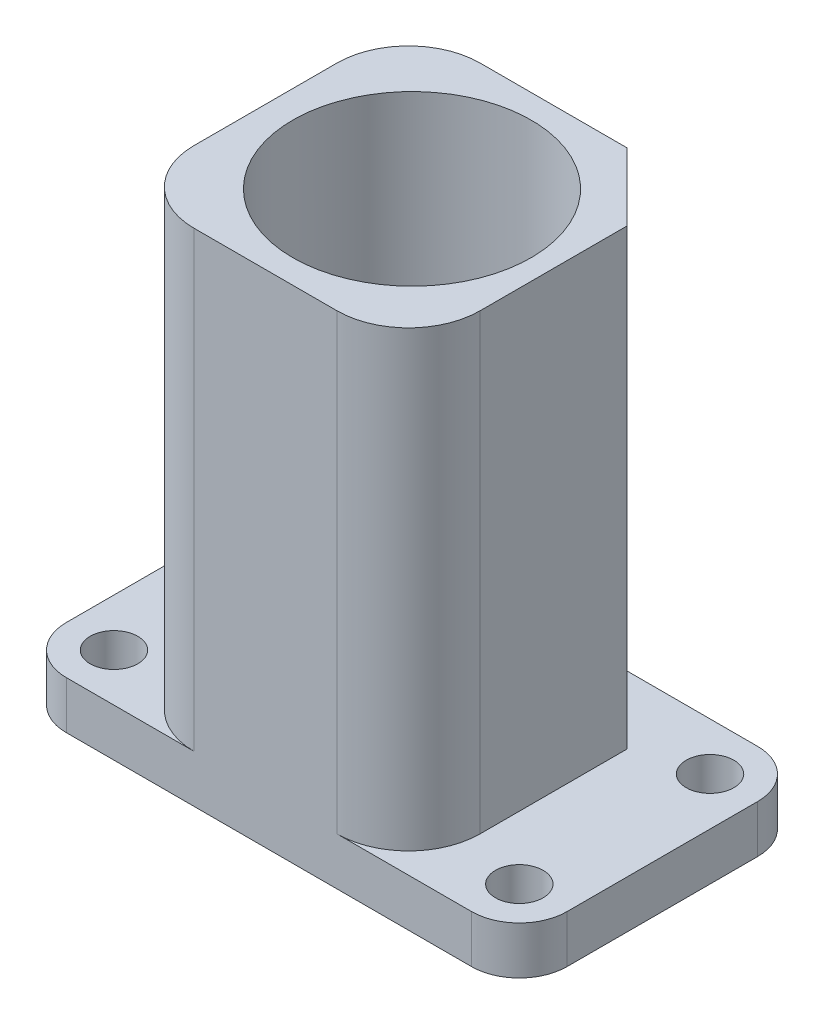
ISO-10303-21;
HEADER;
FILE_DESCRIPTION(('STEP AP214'),'2;1');
FILE_NAME('part.step','',(''),(''),'','','');
FILE_SCHEMA(('AUTOMOTIVE_DESIGN { 1 0 10303 214 1 1 1 1 }'));
ENDSEC;
DATA;
#1=APPLICATION_CONTEXT('core data for automotive mechanical design processes');
#2=APPLICATION_PROTOCOL_DEFINITION('international standard','automotive_design',2000,#1);
#3=PRODUCT_CONTEXT('',#1,'mechanical');
#4=PRODUCT('Part','Part','',(#3));
#5=PRODUCT_RELATED_PRODUCT_CATEGORY('part','',(#4));
#6=PRODUCT_DEFINITION_FORMATION('','',#4);
#7=PRODUCT_DEFINITION_CONTEXT('part definition',#1,'design');
#8=PRODUCT_DEFINITION('design','',#6,#7);
#9=PRODUCT_DEFINITION_SHAPE('','',#8);
#10=(LENGTH_UNIT() NAMED_UNIT(*) SI_UNIT(.MILLI.,.METRE.));
#11=(NAMED_UNIT(*) PLANE_ANGLE_UNIT() SI_UNIT($,.RADIAN.));
#12=(NAMED_UNIT(*) SI_UNIT($,.STERADIAN.) SOLID_ANGLE_UNIT());
#13=UNCERTAINTY_MEASURE_WITH_UNIT(LENGTH_MEASURE(1.E-05),#10,'distance_accuracy_value','');
#14=(GEOMETRIC_REPRESENTATION_CONTEXT(3) GLOBAL_UNCERTAINTY_ASSIGNED_CONTEXT((#13)) GLOBAL_UNIT_ASSIGNED_CONTEXT((#10,
#11,#12)) REPRESENTATION_CONTEXT('',''));
#15=CARTESIAN_POINT('',(0.,0.,0.));
#16=DIRECTION('',(0.,0.,1.));
#17=DIRECTION('',(1.,0.,0.));
#18=AXIS2_PLACEMENT_3D('',#15,#16,#17);
#19=CARTESIAN_POINT('',(0.,1.,0.));
#20=DIRECTION('',(0.,-1.,0.));
#21=DIRECTION('',(0.,0.,-1.));
#22=AXIS2_PLACEMENT_3D('',#19,#20,#21);
#23=PLANE('',#22);
#24=CARTESIAN_POINT('',(4.25,1.,2.));
#25=DIRECTION('',(0.,1.,0.));
#26=DIRECTION('',(0.,0.,1.));
#27=AXIS2_PLACEMENT_3D('',#24,#25,#26);
#28=CIRCLE('',#27,0.500000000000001);
#29=CARTESIAN_POINT('',(4.25,1.,2.5));
#30=VERTEX_POINT('',#29);
#31=EDGE_CURVE('E237',#30,#30,#28,.T.);
#32=ORIENTED_EDGE('',*,*,#31,.F.);
#33=EDGE_LOOP('',(#32));
#34=FACE_BOUND('',#33,.T.);
#35=CARTESIAN_POINT('',(4.25,1.,-2.));
#36=DIRECTION('',(0.,1.,0.));
#37=DIRECTION('',(0.,0.,1.));
#38=AXIS2_PLACEMENT_3D('',#35,#36,#37);
#39=CIRCLE('',#38,0.500000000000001);
#40=CARTESIAN_POINT('',(4.25,1.,-1.5));
#41=VERTEX_POINT('',#40);
#42=EDGE_CURVE('E248',#41,#41,#39,.T.);
#43=ORIENTED_EDGE('',*,*,#42,.F.);
#44=EDGE_LOOP('',(#43));
#45=FACE_BOUND('',#44,.T.);
#46=DIRECTION('',(1.,0.,0.));
#47=VECTOR('',#46,1.);
#48=CARTESIAN_POINT('',(4.25,1.,3.));
#49=LINE('',#48,#47);
#50=CARTESIAN_POINT('',(1.42744530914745,1.,3.));
#51=VERTEX_POINT('',#50);
#52=CARTESIAN_POINT('',(4.25,1.,3.));
#53=VERTEX_POINT('',#52);
#54=EDGE_CURVE('E54',#51,#53,#49,.T.);
#55=ORIENTED_EDGE('',*,*,#54,.T.);
#56=CARTESIAN_POINT('',(4.25,1.,2.));
#57=DIRECTION('',(0.,-1.,0.));
#58=DIRECTION('',(0.,0.,-1.));
#59=AXIS2_PLACEMENT_3D('',#56,#57,#58);
#60=CIRCLE('',#59,1.);
#61=CARTESIAN_POINT('',(5.25,1.,2.));
#62=VERTEX_POINT('',#61);
#63=EDGE_CURVE('E311',#53,#62,#60,.F.);
#64=ORIENTED_EDGE('',*,*,#63,.T.);
#65=DIRECTION('',(0.,0.,1.));
#66=VECTOR('',#65,1.);
#67=CARTESIAN_POINT('',(5.25,1.,-3.));
#68=LINE('',#67,#66);
#69=CARTESIAN_POINT('',(5.25,1.,-2.));
#70=VERTEX_POINT('',#69);
#71=EDGE_CURVE('E266',#70,#62,#68,.T.);
#72=ORIENTED_EDGE('',*,*,#71,.F.);
#73=CARTESIAN_POINT('',(4.25,1.,-2.));
#74=DIRECTION('',(0.,-1.,0.));
#75=DIRECTION('',(0.,0.,-1.));
#76=AXIS2_PLACEMENT_3D('',#73,#74,#75);
#77=CIRCLE('',#76,1.);
#78=CARTESIAN_POINT('',(4.25,1.,-3.));
#79=VERTEX_POINT('',#78);
#80=EDGE_CURVE('E397',#70,#79,#77,.F.);
#81=ORIENTED_EDGE('',*,*,#80,.T.);
#82=DIRECTION('',(-1.,0.,0.));
#83=VECTOR('',#82,1.);
#84=CARTESIAN_POINT('',(4.25,1.,-3.));
#85=LINE('',#84,#83);
#86=CARTESIAN_POINT('',(1.51323174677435,1.,-3.));
#87=VERTEX_POINT('',#86);
#88=EDGE_CURVE('E339',#79,#87,#85,.T.);
#89=ORIENTED_EDGE('',*,*,#88,.T.);
#90=DIRECTION('',(-0.707106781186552,0.,-0.707106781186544));
#91=VECTOR('',#90,1.);
#92=CARTESIAN_POINT('',(1.51323174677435,1.,-3.));
#93=LINE('',#92,#91);
#94=CARTESIAN_POINT('',(2.92744530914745,1.,-1.58578643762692));
#95=VERTEX_POINT('',#94);
#96=EDGE_CURVE('E291',#95,#87,#93,.T.);
#97=ORIENTED_EDGE('',*,*,#96,.F.);
#98=DIRECTION('',(0.,0.,-1.));
#99=VECTOR('',#98,1.);
#100=CARTESIAN_POINT('',(2.92744530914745,1.,-1.58578643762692));
#101=LINE('',#100,#99);
#102=CARTESIAN_POINT('',(2.92744530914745,1.,1.5));
#103=VERTEX_POINT('',#102);
#104=EDGE_CURVE('E310',#103,#95,#101,.T.);
#105=ORIENTED_EDGE('',*,*,#104,.F.);
#106=CARTESIAN_POINT('',(1.42744530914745,1.,1.5));
#107=DIRECTION('',(0.,-1.,0.));
#108=DIRECTION('',(0.,0.,-1.));
#109=AXIS2_PLACEMENT_3D('',#106,#107,#108);
#110=CIRCLE('',#109,1.5);
#111=EDGE_CURVE('E47',#103,#51,#110,.T.);
#112=ORIENTED_EDGE('',*,*,#111,.T.);
#113=EDGE_LOOP('',(#55,#64,#72,#81,#89,#97,#105,#112));
#114=FACE_BOUND('',#113,.T.);
#115=ADVANCED_FACE('F39',(#34,#45,#114),#23,.F.);
#116=CARTESIAN_POINT('',(-4.25,1.,2.));
#117=DIRECTION('',(0.,1.,0.));
#118=DIRECTION('',(0.,0.,1.));
#119=AXIS2_PLACEMENT_3D('',#116,#117,#118);
#120=CIRCLE('',#119,0.5);
#121=CARTESIAN_POINT('',(-4.25,1.,2.5));
#122=VERTEX_POINT('',#121);
#123=EDGE_CURVE('E254',#122,#122,#120,.T.);
#124=ORIENTED_EDGE('',*,*,#123,.F.);
#125=EDGE_LOOP('',(#124));
#126=FACE_BOUND('',#125,.T.);
#127=CARTESIAN_POINT('',(-4.25,1.,-2.));
#128=DIRECTION('',(0.,1.,0.));
#129=DIRECTION('',(0.,0.,1.));
#130=AXIS2_PLACEMENT_3D('',#127,#128,#129);
#131=CIRCLE('',#130,0.5);
#132=CARTESIAN_POINT('',(-4.25,1.,-1.5));
#133=VERTEX_POINT('',#132);
#134=EDGE_CURVE('E260',#133,#133,#131,.T.);
#135=ORIENTED_EDGE('',*,*,#134,.F.);
#136=EDGE_LOOP('',(#135));
#137=FACE_BOUND('',#136,.T.);
#138=DIRECTION('',(0.,0.,-1.));
#139=VECTOR('',#138,1.);
#140=CARTESIAN_POINT('',(-5.25,1.,-3.));
#141=LINE('',#140,#139);
#142=CARTESIAN_POINT('',(-5.25,1.,2.));
#143=VERTEX_POINT('',#142);
#144=CARTESIAN_POINT('',(-5.25,1.,-2.));
#145=VERTEX_POINT('',#144);
#146=EDGE_CURVE('E277',#143,#145,#141,.T.);
#147=ORIENTED_EDGE('',*,*,#146,.F.);
#148=CARTESIAN_POINT('',(-4.25,1.,2.));
#149=DIRECTION('',(0.,-1.,0.));
#150=DIRECTION('',(0.,0.,-1.));
#151=AXIS2_PLACEMENT_3D('',#148,#149,#150);
#152=CIRCLE('',#151,1.);
#153=CARTESIAN_POINT('',(-4.25,1.,3.));
#154=VERTEX_POINT('',#153);
#155=EDGE_CURVE('E783',#143,#154,#152,.F.);
#156=ORIENTED_EDGE('',*,*,#155,.T.);
#157=CARTESIAN_POINT('',(-1.57255469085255,1.,3.));
#158=VERTEX_POINT('',#157);
#159=EDGE_CURVE('E61',#154,#158,#49,.T.);
#160=ORIENTED_EDGE('',*,*,#159,.T.);
#161=CARTESIAN_POINT('',(-1.57255469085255,1.,1.5));
#162=DIRECTION('',(0.,-1.,0.));
#163=DIRECTION('',(0.,0.,-1.));
#164=AXIS2_PLACEMENT_3D('',#161,#162,#163);
#165=CIRCLE('',#164,1.5);
#166=CARTESIAN_POINT('',(-3.07255469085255,1.,1.5));
#167=VERTEX_POINT('',#166);
#168=EDGE_CURVE('E12',#158,#167,#165,.T.);
#169=ORIENTED_EDGE('',*,*,#168,.T.);
#170=DIRECTION('',(0.,0.,1.));
#171=VECTOR('',#170,1.);
#172=CARTESIAN_POINT('',(-3.07255469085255,1.,-3.));
#173=LINE('',#172,#171);
#174=CARTESIAN_POINT('',(-3.07255469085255,1.,-1.5));
#175=VERTEX_POINT('',#174);
#176=EDGE_CURVE('E286',#175,#167,#173,.T.);
#177=ORIENTED_EDGE('',*,*,#176,.F.);
#178=CARTESIAN_POINT('',(-1.57255469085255,1.,-1.5));
#179=DIRECTION('',(0.,-1.,0.));
#180=DIRECTION('',(0.,0.,-1.));
#181=AXIS2_PLACEMENT_3D('',#178,#179,#180);
#182=CIRCLE('',#181,1.5);
#183=CARTESIAN_POINT('',(-1.57255469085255,1.,-3.));
#184=VERTEX_POINT('',#183);
#185=EDGE_CURVE('E429',#175,#184,#182,.T.);
#186=ORIENTED_EDGE('',*,*,#185,.T.);
#187=CARTESIAN_POINT('',(-4.25,1.,-3.));
#188=VERTEX_POINT('',#187);
#189=EDGE_CURVE('E345',#184,#188,#85,.T.);
#190=ORIENTED_EDGE('',*,*,#189,.T.);
#191=CARTESIAN_POINT('',(-4.25,1.,-2.));
#192=DIRECTION('',(0.,-1.,0.));
#193=DIRECTION('',(0.,0.,-1.));
#194=AXIS2_PLACEMENT_3D('',#191,#192,#193);
#195=CIRCLE('',#194,1.);
#196=EDGE_CURVE('E342',#188,#145,#195,.F.);
#197=ORIENTED_EDGE('',*,*,#196,.T.);
#198=EDGE_LOOP('',(#147,#156,#160,#169,#177,#186,#190,#197));
#199=FACE_BOUND('',#198,.T.);
#200=ADVANCED_FACE('F435',(#126,#137,#199),#23,.F.);
#201=CARTESIAN_POINT('',(4.25,1.,3.));
#202=DIRECTION('',(0.,0.,-1.));
#203=DIRECTION('',(-1.,0.,0.));
#204=AXIS2_PLACEMENT_3D('',#201,#202,#203);
#205=PLANE('',#204);
#206=ORIENTED_EDGE('',*,*,#54,.F.);
#207=DIRECTION('',(0.,-1.,0.));
#208=VECTOR('',#207,1.);
#209=CARTESIAN_POINT('',(1.42744530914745,1.,3.));
#210=LINE('',#209,#208);
#211=CARTESIAN_POINT('',(1.42744530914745,10.5,3.));
#212=VERTEX_POINT('',#211);
#213=EDGE_CURVE('E444',#51,#212,#210,.F.);
#214=ORIENTED_EDGE('',*,*,#213,.T.);
#215=DIRECTION('',(1.,0.,0.));
#216=VECTOR('',#215,1.);
#217=CARTESIAN_POINT('',(2.92744530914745,10.5,3.));
#218=LINE('',#217,#216);
#219=CARTESIAN_POINT('',(-1.57255469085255,10.5,3.));
#220=VERTEX_POINT('',#219);
#221=EDGE_CURVE('E294',#220,#212,#218,.T.);
#222=ORIENTED_EDGE('',*,*,#221,.F.);
#223=DIRECTION('',(0.,-1.,0.));
#224=VECTOR('',#223,1.);
#225=CARTESIAN_POINT('',(-1.57255469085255,1.,3.));
#226=LINE('',#225,#224);
#227=EDGE_CURVE('E440',#220,#158,#226,.T.);
#228=ORIENTED_EDGE('',*,*,#227,.T.);
#229=ORIENTED_EDGE('',*,*,#159,.F.);
#230=DIRECTION('',(0.,1.,0.));
#231=VECTOR('',#230,1.);
#232=CARTESIAN_POINT('',(-4.25,0.,3.));
#233=LINE('',#232,#231);
#234=CARTESIAN_POINT('',(-4.25,0.,3.));
#235=VERTEX_POINT('',#234);
#236=EDGE_CURVE('E413',#154,#235,#233,.F.);
#237=ORIENTED_EDGE('',*,*,#236,.T.);
#238=DIRECTION('',(1.,0.,0.));
#239=VECTOR('',#238,1.);
#240=CARTESIAN_POINT('',(4.25,0.,3.));
#241=LINE('',#240,#239);
#242=CARTESIAN_POINT('',(4.25,0.,3.));
#243=VERTEX_POINT('',#242);
#244=EDGE_CURVE('E366',#235,#243,#241,.T.);
#245=ORIENTED_EDGE('',*,*,#244,.T.);
#246=DIRECTION('',(0.,-1.,0.));
#247=VECTOR('',#246,1.);
#248=CARTESIAN_POINT('',(4.25,1.,3.));
#249=LINE('',#248,#247);
#250=EDGE_CURVE('E409',#243,#53,#249,.F.);
#251=ORIENTED_EDGE('',*,*,#250,.T.);
#252=EDGE_LOOP('',(#206,#214,#222,#228,#229,#237,#245,#251));
#253=FACE_BOUND('',#252,.T.);
#254=ADVANCED_FACE('F442',(#253),#205,.F.);
#255=CARTESIAN_POINT('',(4.25,1.,-3.));
#256=DIRECTION('',(0.,0.,1.));
#257=DIRECTION('',(1.,0.,0.));
#258=AXIS2_PLACEMENT_3D('',#255,#256,#257);
#259=PLANE('',#258);
#260=ORIENTED_EDGE('',*,*,#189,.F.);
#261=DIRECTION('',(0.,-1.,0.));
#262=VECTOR('',#261,1.);
#263=CARTESIAN_POINT('',(-1.57255469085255,1.,-3.));
#264=LINE('',#263,#262);
#265=CARTESIAN_POINT('',(-1.57255469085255,10.5,-3.));
#266=VERTEX_POINT('',#265);
#267=EDGE_CURVE('E318',#184,#266,#264,.F.);
#268=ORIENTED_EDGE('',*,*,#267,.T.);
#269=DIRECTION('',(-1.,0.,0.));
#270=VECTOR('',#269,1.);
#271=CARTESIAN_POINT('',(1.51323174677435,10.5,-3.));
#272=LINE('',#271,#270);
#273=CARTESIAN_POINT('',(1.51323174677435,10.5,-3.));
#274=VERTEX_POINT('',#273);
#275=EDGE_CURVE('E287',#274,#266,#272,.T.);
#276=ORIENTED_EDGE('',*,*,#275,.F.);
#277=DIRECTION('',(0.,-1.,0.));
#278=VECTOR('',#277,1.);
#279=CARTESIAN_POINT('',(1.51323174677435,10.5,-3.));
#280=LINE('',#279,#278);
#281=EDGE_CURVE('E301',#274,#87,#280,.T.);
#282=ORIENTED_EDGE('',*,*,#281,.T.);
#283=ORIENTED_EDGE('',*,*,#88,.F.);
#284=DIRECTION('',(0.,1.,0.));
#285=VECTOR('',#284,1.);
#286=CARTESIAN_POINT('',(4.25,1.,-3.));
#287=LINE('',#286,#285);
#288=CARTESIAN_POINT('',(4.25,0.,-3.));
#289=VERTEX_POINT('',#288);
#290=EDGE_CURVE('E379',#79,#289,#287,.F.);
#291=ORIENTED_EDGE('',*,*,#290,.T.);
#292=DIRECTION('',(-1.,0.,0.));
#293=VECTOR('',#292,1.);
#294=CARTESIAN_POINT('',(4.25,0.,-3.));
#295=LINE('',#294,#293);
#296=CARTESIAN_POINT('',(-4.25,0.,-3.));
#297=VERTEX_POINT('',#296);
#298=EDGE_CURVE('E356',#289,#297,#295,.T.);
#299=ORIENTED_EDGE('',*,*,#298,.T.);
#300=DIRECTION('',(0.,-1.,0.));
#301=VECTOR('',#300,1.);
#302=CARTESIAN_POINT('',(-4.25,1.,-3.));
#303=LINE('',#302,#301);
#304=EDGE_CURVE('E377',#297,#188,#303,.F.);
#305=ORIENTED_EDGE('',*,*,#304,.T.);
#306=EDGE_LOOP('',(#260,#268,#276,#282,#283,#291,#299,#305));
#307=FACE_BOUND('',#306,.T.);
#308=ADVANCED_FACE('F376',(#307),#259,.F.);
#309=CARTESIAN_POINT('',(0.,0.,0.));
#310=DIRECTION('',(0.,-1.,0.));
#311=DIRECTION('',(0.,0.,-1.));
#312=AXIS2_PLACEMENT_3D('',#309,#310,#311);
#313=PLANE('',#312);
#314=CARTESIAN_POINT('',(2.,0.,1.5));
#315=DIRECTION('',(0.,-1.,0.));
#316=DIRECTION('',(0.,0.,-1.));
#317=AXIS2_PLACEMENT_3D('',#314,#315,#316);
#318=CIRCLE('',#317,0.5);
#319=CARTESIAN_POINT('',(2.,0.,1.));
#320=VERTEX_POINT('',#319);
#321=CARTESIAN_POINT('',(2.,0.,2.));
#322=VERTEX_POINT('',#321);
#323=EDGE_CURVE('E201',#320,#322,#318,.T.);
#324=ORIENTED_EDGE('',*,*,#323,.F.);
#325=DIRECTION('',(0.,0.,1.));
#326=VECTOR('',#325,1.);
#327=CARTESIAN_POINT('',(2.,0.,2.));
#328=LINE('',#327,#326);
#329=CARTESIAN_POINT('',(2.,0.,-2.));
#330=VERTEX_POINT('',#329);
#331=EDGE_CURVE('E217',#330,#320,#328,.T.);
#332=ORIENTED_EDGE('',*,*,#331,.F.);
#333=CARTESIAN_POINT('',(1.5,0.,-2.));
#334=DIRECTION('',(0.,-1.,0.));
#335=DIRECTION('',(0.,0.,-1.));
#336=AXIS2_PLACEMENT_3D('',#333,#334,#335);
#337=CIRCLE('',#336,0.5);
#338=CARTESIAN_POINT('',(1.,0.,-2.));
#339=VERTEX_POINT('',#338);
#340=EDGE_CURVE('E209',#339,#330,#337,.T.);
#341=ORIENTED_EDGE('',*,*,#340,.F.);
#342=DIRECTION('',(1.,0.,0.));
#343=VECTOR('',#342,1.);
#344=CARTESIAN_POINT('',(2.,0.,-2.));
#345=LINE('',#344,#343);
#346=CARTESIAN_POINT('',(-2.,0.,-2.));
#347=VERTEX_POINT('',#346);
#348=EDGE_CURVE('E225',#347,#339,#345,.T.);
#349=ORIENTED_EDGE('',*,*,#348,.F.);
#350=CARTESIAN_POINT('',(-2.,0.,-1.5));
#351=DIRECTION('',(0.,-1.,0.));
#352=DIRECTION('',(0.,0.,-1.));
#353=AXIS2_PLACEMENT_3D('',#350,#351,#352);
#354=CIRCLE('',#353,0.5);
#355=CARTESIAN_POINT('',(-2.,0.,-1.));
#356=VERTEX_POINT('',#355);
#357=EDGE_CURVE('E831',#356,#347,#354,.T.);
#358=ORIENTED_EDGE('',*,*,#357,.F.);
#359=DIRECTION('',(0.,0.,-1.));
#360=VECTOR('',#359,1.);
#361=CARTESIAN_POINT('',(-2.,0.,2.));
#362=LINE('',#361,#360);
#363=CARTESIAN_POINT('',(-2.,0.,2.));
#364=VERTEX_POINT('',#363);
#365=EDGE_CURVE('E230',#364,#356,#362,.T.);
#366=ORIENTED_EDGE('',*,*,#365,.F.);
#367=CARTESIAN_POINT('',(-1.5,0.,2.));
#368=DIRECTION('',(0.,-1.,0.));
#369=DIRECTION('',(0.,0.,-1.));
#370=AXIS2_PLACEMENT_3D('',#367,#368,#369);
#371=CIRCLE('',#370,0.5);
#372=CARTESIAN_POINT('',(-1.,0.,2.));
#373=VERTEX_POINT('',#372);
#374=EDGE_CURVE('E821',#373,#364,#371,.T.);
#375=ORIENTED_EDGE('',*,*,#374,.F.);
#376=DIRECTION('',(-1.,0.,0.));
#377=VECTOR('',#376,1.);
#378=CARTESIAN_POINT('',(2.,0.,2.));
#379=LINE('',#378,#377);
#380=EDGE_CURVE('E220',#322,#373,#379,.T.);
#381=ORIENTED_EDGE('',*,*,#380,.F.);
#382=EDGE_LOOP('',(#324,#332,#341,#349,#358,#366,#375,#381));
#383=FACE_BOUND('',#382,.T.);
#384=CARTESIAN_POINT('',(4.25,0.,2.));
#385=DIRECTION('',(0.,1.,0.));
#386=DIRECTION('',(0.,0.,1.));
#387=AXIS2_PLACEMENT_3D('',#384,#385,#386);
#388=CIRCLE('',#387,0.500000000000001);
#389=CARTESIAN_POINT('',(4.25,0.,2.5));
#390=VERTEX_POINT('',#389);
#391=EDGE_CURVE('E245',#390,#390,#388,.T.);
#392=ORIENTED_EDGE('',*,*,#391,.T.);
#393=EDGE_LOOP('',(#392));
#394=FACE_BOUND('',#393,.T.);
#395=CARTESIAN_POINT('',(4.25,0.,-2.));
#396=DIRECTION('',(0.,1.,0.));
#397=DIRECTION('',(0.,0.,1.));
#398=AXIS2_PLACEMENT_3D('',#395,#396,#397);
#399=CIRCLE('',#398,0.500000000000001);
#400=CARTESIAN_POINT('',(4.25,0.,-1.5));
#401=VERTEX_POINT('',#400);
#402=EDGE_CURVE('E251',#401,#401,#399,.T.);
#403=ORIENTED_EDGE('',*,*,#402,.T.);
#404=EDGE_LOOP('',(#403));
#405=FACE_BOUND('',#404,.T.);
#406=CARTESIAN_POINT('',(-4.25,0.,2.));
#407=DIRECTION('',(0.,1.,0.));
#408=DIRECTION('',(0.,0.,1.));
#409=AXIS2_PLACEMENT_3D('',#406,#407,#408);
#410=CIRCLE('',#409,0.5);
#411=CARTESIAN_POINT('',(-4.25,0.,2.5));
#412=VERTEX_POINT('',#411);
#413=EDGE_CURVE('E257',#412,#412,#410,.T.);
#414=ORIENTED_EDGE('',*,*,#413,.T.);
#415=EDGE_LOOP('',(#414));
#416=FACE_BOUND('',#415,.T.);
#417=CARTESIAN_POINT('',(-4.25,0.,-2.));
#418=DIRECTION('',(0.,1.,0.));
#419=DIRECTION('',(0.,0.,1.));
#420=AXIS2_PLACEMENT_3D('',#417,#418,#419);
#421=CIRCLE('',#420,0.5);
#422=CARTESIAN_POINT('',(-4.25,0.,-1.5));
#423=VERTEX_POINT('',#422);
#424=EDGE_CURVE('E263',#423,#423,#421,.T.);
#425=ORIENTED_EDGE('',*,*,#424,.T.);
#426=EDGE_LOOP('',(#425));
#427=FACE_BOUND('',#426,.T.);
#428=ORIENTED_EDGE('',*,*,#244,.F.);
#429=CARTESIAN_POINT('',(-4.25,0.,2.));
#430=DIRECTION('',(0.,-1.,0.));
#431=DIRECTION('',(0.,0.,-1.));
#432=AXIS2_PLACEMENT_3D('',#429,#430,#431);
#433=CIRCLE('',#432,1.);
#434=CARTESIAN_POINT('',(-5.25,0.,2.));
#435=VERTEX_POINT('',#434);
#436=EDGE_CURVE('E392',#235,#435,#433,.T.);
#437=ORIENTED_EDGE('',*,*,#436,.T.);
#438=DIRECTION('',(0.,0.,1.));
#439=VECTOR('',#438,1.);
#440=CARTESIAN_POINT('',(-5.25,0.,-3.));
#441=LINE('',#440,#439);
#442=CARTESIAN_POINT('',(-5.25,0.,-2.));
#443=VERTEX_POINT('',#442);
#444=EDGE_CURVE('E274',#443,#435,#441,.T.);
#445=ORIENTED_EDGE('',*,*,#444,.F.);
#446=CARTESIAN_POINT('',(-4.25,0.,-2.));
#447=DIRECTION('',(0.,-1.,0.));
#448=DIRECTION('',(0.,0.,-1.));
#449=AXIS2_PLACEMENT_3D('',#446,#447,#448);
#450=CIRCLE('',#449,1.);
#451=EDGE_CURVE('E386',#443,#297,#450,.T.);
#452=ORIENTED_EDGE('',*,*,#451,.T.);
#453=ORIENTED_EDGE('',*,*,#298,.F.);
#454=CARTESIAN_POINT('',(4.25,0.,-2.));
#455=DIRECTION('',(0.,-1.,0.));
#456=DIRECTION('',(0.,0.,-1.));
#457=AXIS2_PLACEMENT_3D('',#454,#455,#456);
#458=CIRCLE('',#457,1.);
#459=CARTESIAN_POINT('',(5.25,0.,-2.));
#460=VERTEX_POINT('',#459);
#461=EDGE_CURVE('E410',#289,#460,#458,.T.);
#462=ORIENTED_EDGE('',*,*,#461,.T.);
#463=DIRECTION('',(0.,0.,-1.));
#464=VECTOR('',#463,1.);
#465=CARTESIAN_POINT('',(5.25,0.,-3.));
#466=LINE('',#465,#464);
#467=CARTESIAN_POINT('',(5.25,0.,2.));
#468=VERTEX_POINT('',#467);
#469=EDGE_CURVE('E271',#468,#460,#466,.T.);
#470=ORIENTED_EDGE('',*,*,#469,.F.);
#471=CARTESIAN_POINT('',(4.25,0.,2.));
#472=DIRECTION('',(0.,-1.,0.));
#473=DIRECTION('',(0.,0.,-1.));
#474=AXIS2_PLACEMENT_3D('',#471,#472,#473);
#475=CIRCLE('',#474,1.);
#476=EDGE_CURVE('E408',#468,#243,#475,.T.);
#477=ORIENTED_EDGE('',*,*,#476,.T.);
#478=EDGE_LOOP('',(#428,#437,#445,#452,#453,#462,#470,#477));
#479=FACE_BOUND('',#478,.T.);
#480=ADVANCED_FACE('F214',(#383,#394,#405,#416,#427,#479),#313,.T.);
#481=CARTESIAN_POINT('',(-3.07255469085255,10.5,-3.));
#482=DIRECTION('',(1.,0.,0.));
#483=DIRECTION('',(0.,0.,-1.));
#484=AXIS2_PLACEMENT_3D('',#481,#482,#483);
#485=PLANE('',#484);
#486=DIRECTION('',(0.,0.,1.));
#487=VECTOR('',#486,1.);
#488=CARTESIAN_POINT('',(-3.07255469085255,10.5,-3.));
#489=LINE('',#488,#487);
#490=CARTESIAN_POINT('',(-3.07255469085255,10.5,-1.5));
#491=VERTEX_POINT('',#490);
#492=CARTESIAN_POINT('',(-3.07255469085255,10.5,1.5));
#493=VERTEX_POINT('',#492);
#494=EDGE_CURVE('E290',#491,#493,#489,.T.);
#495=ORIENTED_EDGE('',*,*,#494,.F.);
#496=DIRECTION('',(0.,-1.,0.));
#497=VECTOR('',#496,1.);
#498=CARTESIAN_POINT('',(-3.07255469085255,10.5,-1.5));
#499=LINE('',#498,#497);
#500=EDGE_CURVE('E315',#491,#175,#499,.T.);
#501=ORIENTED_EDGE('',*,*,#500,.T.);
#502=ORIENTED_EDGE('',*,*,#176,.T.);
#503=DIRECTION('',(0.,-1.,0.));
#504=VECTOR('',#503,1.);
#505=CARTESIAN_POINT('',(-3.07255469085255,10.5,1.5));
#506=LINE('',#505,#504);
#507=EDGE_CURVE('E313',#167,#493,#506,.F.);
#508=ORIENTED_EDGE('',*,*,#507,.T.);
#509=EDGE_LOOP('',(#495,#501,#502,#508));
#510=FACE_BOUND('',#509,.T.);
#511=ADVANCED_FACE('F432',(#510),#485,.F.);
#512=CARTESIAN_POINT('',(2.92744530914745,10.5,-1.58578643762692));
#513=DIRECTION('',(-1.,0.,0.));
#514=DIRECTION('',(0.,0.,1.));
#515=AXIS2_PLACEMENT_3D('',#512,#513,#514);
#516=PLANE('',#515);
#517=DIRECTION('',(0.,0.,-1.));
#518=VECTOR('',#517,1.);
#519=CARTESIAN_POINT('',(2.92744530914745,10.5,-1.58578643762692));
#520=LINE('',#519,#518);
#521=CARTESIAN_POINT('',(2.92744530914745,10.5,1.5));
#522=VERTEX_POINT('',#521);
#523=CARTESIAN_POINT('',(2.92744530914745,10.5,-1.58578643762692));
#524=VERTEX_POINT('',#523);
#525=EDGE_CURVE('E297',#522,#524,#520,.T.);
#526=ORIENTED_EDGE('',*,*,#525,.F.);
#527=DIRECTION('',(0.,-1.,0.));
#528=VECTOR('',#527,1.);
#529=CARTESIAN_POINT('',(2.92744530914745,10.5,1.5));
#530=LINE('',#529,#528);
#531=EDGE_CURVE('E326',#522,#103,#530,.T.);
#532=ORIENTED_EDGE('',*,*,#531,.T.);
#533=ORIENTED_EDGE('',*,*,#104,.T.);
#534=DIRECTION('',(0.,-1.,0.));
#535=VECTOR('',#534,1.);
#536=CARTESIAN_POINT('',(2.92744530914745,10.5,-1.58578643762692));
#537=LINE('',#536,#535);
#538=EDGE_CURVE('E349',#524,#95,#537,.T.);
#539=ORIENTED_EDGE('',*,*,#538,.F.);
#540=EDGE_LOOP('',(#526,#532,#533,#539));
#541=FACE_BOUND('',#540,.T.);
#542=ADVANCED_FACE('F455',(#541),#516,.F.);
#543=CARTESIAN_POINT('',(1.51323174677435,10.5,-3.));
#544=DIRECTION('',(-0.707106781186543,0.,0.707106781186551));
#545=DIRECTION('',(0.707106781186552,0.,0.707106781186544));
#546=AXIS2_PLACEMENT_3D('',#543,#544,#545);
#547=PLANE('',#546);
#548=ORIENTED_EDGE('',*,*,#96,.T.);
#549=ORIENTED_EDGE('',*,*,#281,.F.);
#550=DIRECTION('',(-0.707106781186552,0.,-0.707106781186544));
#551=VECTOR('',#550,1.);
#552=CARTESIAN_POINT('',(1.51323174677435,10.5,-3.));
#553=LINE('',#552,#551);
#554=EDGE_CURVE('E299',#524,#274,#553,.T.);
#555=ORIENTED_EDGE('',*,*,#554,.F.);
#556=ORIENTED_EDGE('',*,*,#538,.T.);
#557=EDGE_LOOP('',(#548,#549,#555,#556));
#558=FACE_BOUND('',#557,.T.);
#559=ADVANCED_FACE('F419',(#558),#547,.F.);
#560=CARTESIAN_POINT('',(0.,10.5,0.));
#561=DIRECTION('',(0.,1.,0.));
#562=DIRECTION('',(0.,0.,1.));
#563=AXIS2_PLACEMENT_3D('',#560,#561,#562);
#564=PLANE('',#563);
#565=CARTESIAN_POINT('',(0.,10.5,0.));
#566=DIRECTION('',(0.,1.,0.));
#567=DIRECTION('',(0.,0.,1.));
#568=AXIS2_PLACEMENT_3D('',#565,#566,#567);
#569=CIRCLE('',#568,2.5);
#570=CARTESIAN_POINT('',(0.,10.5,2.5));
#571=VERTEX_POINT('',#570);
#572=EDGE_CURVE('E280',#571,#571,#569,.T.);
#573=ORIENTED_EDGE('',*,*,#572,.F.);
#574=EDGE_LOOP('',(#573));
#575=FACE_BOUND('',#574,.T.);
#576=ORIENTED_EDGE('',*,*,#275,.T.);
#577=CARTESIAN_POINT('',(-1.57255469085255,10.5,-1.5));
#578=DIRECTION('',(0.,1.,0.));
#579=DIRECTION('',(0.,0.,1.));
#580=AXIS2_PLACEMENT_3D('',#577,#578,#579);
#581=CIRCLE('',#580,1.5);
#582=EDGE_CURVE('E324',#266,#491,#581,.T.);
#583=ORIENTED_EDGE('',*,*,#582,.T.);
#584=ORIENTED_EDGE('',*,*,#494,.T.);
#585=CARTESIAN_POINT('',(-1.57255469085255,10.5,1.5));
#586=DIRECTION('',(0.,1.,0.));
#587=DIRECTION('',(0.,0.,1.));
#588=AXIS2_PLACEMENT_3D('',#585,#586,#587);
#589=CIRCLE('',#588,1.5);
#590=EDGE_CURVE('E320',#493,#220,#589,.T.);
#591=ORIENTED_EDGE('',*,*,#590,.T.);
#592=ORIENTED_EDGE('',*,*,#221,.T.);
#593=CARTESIAN_POINT('',(1.42744530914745,10.5,1.5));
#594=DIRECTION('',(0.,1.,0.));
#595=DIRECTION('',(0.,0.,1.));
#596=AXIS2_PLACEMENT_3D('',#593,#594,#595);
#597=CIRCLE('',#596,1.5);
#598=EDGE_CURVE('E322',#212,#522,#597,.T.);
#599=ORIENTED_EDGE('',*,*,#598,.T.);
#600=ORIENTED_EDGE('',*,*,#525,.T.);
#601=ORIENTED_EDGE('',*,*,#554,.T.);
#602=EDGE_LOOP('',(#576,#583,#584,#591,#592,#599,#600,#601));
#603=FACE_BOUND('',#602,.T.);
#604=ADVANCED_FACE('F423',(#575,#603),#564,.T.);
#605=CARTESIAN_POINT('',(0.,2.,0.));
#606=DIRECTION('',(0.,-1.,0.));
#607=DIRECTION('',(0.,0.,-1.));
#608=AXIS2_PLACEMENT_3D('',#605,#606,#607);
#609=PLANE('',#608);
#610=CARTESIAN_POINT('',(0.,2.,0.));
#611=DIRECTION('',(0.,-1.,0.));
#612=DIRECTION('',(0.,0.,-1.));
#613=AXIS2_PLACEMENT_3D('',#610,#611,#612);
#614=CIRCLE('',#613,1.75);
#615=CARTESIAN_POINT('',(0.,2.,-1.75));
#616=VERTEX_POINT('',#615);
#617=EDGE_CURVE('E797',#616,#616,#614,.T.);
#618=ORIENTED_EDGE('',*,*,#617,.T.);
#619=EDGE_LOOP('',(#618));
#620=FACE_BOUND('',#619,.T.);
#621=CARTESIAN_POINT('',(0.,2.,0.));
#622=DIRECTION('',(0.,-1.,0.));
#623=DIRECTION('',(0.,0.,-1.));
#624=AXIS2_PLACEMENT_3D('',#621,#622,#623);
#625=CIRCLE('',#624,2.5);
#626=CARTESIAN_POINT('',(0.,2.,-2.5));
#627=VERTEX_POINT('',#626);
#628=EDGE_CURVE('E283',#627,#627,#625,.F.);
#629=ORIENTED_EDGE('',*,*,#628,.T.);
#630=EDGE_LOOP('',(#629));
#631=FACE_BOUND('',#630,.T.);
#632=ADVANCED_FACE('F518',(#620,#631),#609,.F.);
#633=CARTESIAN_POINT('',(0.,-7.07106781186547,0.));
#634=DIRECTION('',(0.,1.,0.));
#635=DIRECTION('',(0.,0.,1.));
#636=AXIS2_PLACEMENT_3D('',#633,#634,#635);
#637=CYLINDRICAL_SURFACE('',#636,2.5);
#638=ORIENTED_EDGE('',*,*,#572,.T.);
#639=EDGE_LOOP('',(#638));
#640=FACE_BOUND('',#639,.T.);
#641=ORIENTED_EDGE('',*,*,#628,.F.);
#642=EDGE_LOOP('',(#641));
#643=FACE_BOUND('',#642,.T.);
#644=ADVANCED_FACE('F608',(#640,#643),#637,.F.);
#645=CARTESIAN_POINT('',(-5.25,0.,0.));
#646=DIRECTION('',(-1.,0.,0.));
#647=DIRECTION('',(0.,0.,1.));
#648=AXIS2_PLACEMENT_3D('',#645,#646,#647);
#649=PLANE('',#648);
#650=ORIENTED_EDGE('',*,*,#444,.T.);
#651=DIRECTION('',(0.,1.,0.));
#652=VECTOR('',#651,1.);
#653=CARTESIAN_POINT('',(-5.25,1.,2.));
#654=LINE('',#653,#652);
#655=EDGE_CURVE('E338',#435,#143,#654,.T.);
#656=ORIENTED_EDGE('',*,*,#655,.T.);
#657=ORIENTED_EDGE('',*,*,#146,.T.);
#658=DIRECTION('',(0.,-1.,0.));
#659=VECTOR('',#658,1.);
#660=CARTESIAN_POINT('',(-5.25,0.,-2.));
#661=LINE('',#660,#659);
#662=EDGE_CURVE('E335',#145,#443,#661,.T.);
#663=ORIENTED_EDGE('',*,*,#662,.T.);
#664=EDGE_LOOP('',(#650,#656,#657,#663));
#665=FACE_BOUND('',#664,.T.);
#666=ADVANCED_FACE('F598',(#665),#649,.T.);
#667=CARTESIAN_POINT('',(5.25,0.,0.));
#668=DIRECTION('',(-1.,0.,0.));
#669=DIRECTION('',(0.,0.,1.));
#670=AXIS2_PLACEMENT_3D('',#667,#668,#669);
#671=PLANE('',#670);
#672=ORIENTED_EDGE('',*,*,#71,.T.);
#673=DIRECTION('',(0.,-1.,0.));
#674=VECTOR('',#673,1.);
#675=CARTESIAN_POINT('',(5.25,0.,2.));
#676=LINE('',#675,#674);
#677=EDGE_CURVE('E390',#62,#468,#676,.T.);
#678=ORIENTED_EDGE('',*,*,#677,.T.);
#679=ORIENTED_EDGE('',*,*,#469,.T.);
#680=DIRECTION('',(0.,1.,0.));
#681=VECTOR('',#680,1.);
#682=CARTESIAN_POINT('',(5.25,0.,-2.));
#683=LINE('',#682,#681);
#684=EDGE_CURVE('E387',#460,#70,#683,.T.);
#685=ORIENTED_EDGE('',*,*,#684,.T.);
#686=EDGE_LOOP('',(#672,#678,#679,#685));
#687=FACE_BOUND('',#686,.T.);
#688=ADVANCED_FACE('F404',(#687),#671,.F.);
#689=CARTESIAN_POINT('',(-4.25,0.,-2.));
#690=DIRECTION('',(0.,1.,0.));
#691=DIRECTION('',(0.,0.,1.));
#692=AXIS2_PLACEMENT_3D('',#689,#690,#691);
#693=CYLINDRICAL_SURFACE('',#692,0.5);
#694=ORIENTED_EDGE('',*,*,#424,.F.);
#695=EDGE_LOOP('',(#694));
#696=FACE_BOUND('',#695,.T.);
#697=ORIENTED_EDGE('',*,*,#134,.T.);
#698=EDGE_LOOP('',(#697));
#699=FACE_BOUND('',#698,.T.);
#700=ADVANCED_FACE('F597',(#696,#699),#693,.F.);
#701=CARTESIAN_POINT('',(-4.25,0.,2.));
#702=DIRECTION('',(0.,1.,0.));
#703=DIRECTION('',(0.,0.,1.));
#704=AXIS2_PLACEMENT_3D('',#701,#702,#703);
#705=CYLINDRICAL_SURFACE('',#704,0.5);
#706=ORIENTED_EDGE('',*,*,#413,.F.);
#707=EDGE_LOOP('',(#706));
#708=FACE_BOUND('',#707,.T.);
#709=ORIENTED_EDGE('',*,*,#123,.T.);
#710=EDGE_LOOP('',(#709));
#711=FACE_BOUND('',#710,.T.);
#712=ADVANCED_FACE('F738',(#708,#711),#705,.F.);
#713=CARTESIAN_POINT('',(4.25,0.,-2.));
#714=DIRECTION('',(0.,1.,0.));
#715=DIRECTION('',(0.,0.,1.));
#716=AXIS2_PLACEMENT_3D('',#713,#714,#715);
#717=CYLINDRICAL_SURFACE('',#716,0.500000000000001);
#718=ORIENTED_EDGE('',*,*,#402,.F.);
#719=EDGE_LOOP('',(#718));
#720=FACE_BOUND('',#719,.T.);
#721=ORIENTED_EDGE('',*,*,#42,.T.);
#722=EDGE_LOOP('',(#721));
#723=FACE_BOUND('',#722,.T.);
#724=ADVANCED_FACE('F728',(#720,#723),#717,.F.);
#725=CARTESIAN_POINT('',(4.25,0.,2.));
#726=DIRECTION('',(0.,1.,0.));
#727=DIRECTION('',(0.,0.,1.));
#728=AXIS2_PLACEMENT_3D('',#725,#726,#727);
#729=CYLINDRICAL_SURFACE('',#728,0.500000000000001);
#730=ORIENTED_EDGE('',*,*,#391,.F.);
#731=EDGE_LOOP('',(#730));
#732=FACE_BOUND('',#731,.T.);
#733=ORIENTED_EDGE('',*,*,#31,.T.);
#734=EDGE_LOOP('',(#733));
#735=FACE_BOUND('',#734,.T.);
#736=ADVANCED_FACE('F704',(#732,#735),#729,.F.);
#737=CARTESIAN_POINT('',(-2.,1.3,2.));
#738=DIRECTION('',(-1.,0.,0.));
#739=DIRECTION('',(0.,0.,1.));
#740=AXIS2_PLACEMENT_3D('',#737,#738,#739);
#741=PLANE('',#740);
#742=ORIENTED_EDGE('',*,*,#365,.T.);
#743=DIRECTION('',(0.,-1.,0.));
#744=VECTOR('',#743,1.);
#745=CARTESIAN_POINT('',(-2.,2.7142135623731,-1.));
#746=LINE('',#745,#744);
#747=CARTESIAN_POINT('',(-2.,1.3,-1.));
#748=VERTEX_POINT('',#747);
#749=EDGE_CURVE('E825',#356,#748,#746,.F.);
#750=ORIENTED_EDGE('',*,*,#749,.T.);
#751=DIRECTION('',(0.,0.,-1.));
#752=VECTOR('',#751,1.);
#753=CARTESIAN_POINT('',(-2.,1.3,2.));
#754=LINE('',#753,#752);
#755=CARTESIAN_POINT('',(-2.,1.3,2.));
#756=VERTEX_POINT('',#755);
#757=EDGE_CURVE('E227',#756,#748,#754,.T.);
#758=ORIENTED_EDGE('',*,*,#757,.F.);
#759=DIRECTION('',(0.,-1.,0.));
#760=VECTOR('',#759,1.);
#761=CARTESIAN_POINT('',(-2.,1.3,2.));
#762=LINE('',#761,#760);
#763=EDGE_CURVE('E234',#756,#364,#762,.T.);
#764=ORIENTED_EDGE('',*,*,#763,.T.);
#765=EDGE_LOOP('',(#742,#750,#758,#764));
#766=FACE_BOUND('',#765,.T.);
#767=ADVANCED_FACE('F694',(#766),#741,.F.);
#768=CARTESIAN_POINT('',(2.,1.3,2.));
#769=DIRECTION('',(0.,0.,1.));
#770=DIRECTION('',(1.,0.,0.));
#771=AXIS2_PLACEMENT_3D('',#768,#769,#770);
#772=PLANE('',#771);
#773=ORIENTED_EDGE('',*,*,#380,.T.);
#774=DIRECTION('',(0.,-1.,0.));
#775=VECTOR('',#774,1.);
#776=CARTESIAN_POINT('',(-1.,2.7142135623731,2.));
#777=LINE('',#776,#775);
#778=CARTESIAN_POINT('',(-1.,1.3,2.));
#779=VERTEX_POINT('',#778);
#780=EDGE_CURVE('E803',#373,#779,#777,.F.);
#781=ORIENTED_EDGE('',*,*,#780,.T.);
#782=DIRECTION('',(-1.,0.,0.));
#783=VECTOR('',#782,1.);
#784=CARTESIAN_POINT('',(2.,1.3,2.));
#785=LINE('',#784,#783);
#786=CARTESIAN_POINT('',(2.,1.3,2.));
#787=VERTEX_POINT('',#786);
#788=EDGE_CURVE('E244',#787,#779,#785,.T.);
#789=ORIENTED_EDGE('',*,*,#788,.F.);
#790=DIRECTION('',(0.,-1.,0.));
#791=VECTOR('',#790,1.);
#792=CARTESIAN_POINT('',(2.,1.3,2.));
#793=LINE('',#792,#791);
#794=EDGE_CURVE('E238',#787,#322,#793,.T.);
#795=ORIENTED_EDGE('',*,*,#794,.T.);
#796=EDGE_LOOP('',(#773,#781,#789,#795));
#797=FACE_BOUND('',#796,.T.);
#798=ADVANCED_FACE('F685',(#797),#772,.F.);
#799=CARTESIAN_POINT('',(2.,1.3,2.));
#800=DIRECTION('',(1.,0.,0.));
#801=DIRECTION('',(0.,0.,-1.));
#802=AXIS2_PLACEMENT_3D('',#799,#800,#801);
#803=PLANE('',#802);
#804=ORIENTED_EDGE('',*,*,#331,.T.);
#805=DIRECTION('',(0.,-1.,0.));
#806=VECTOR('',#805,1.);
#807=CARTESIAN_POINT('',(2.,2.7142135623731,1.));
#808=LINE('',#807,#806);
#809=CARTESIAN_POINT('',(2.,1.3,1.));
#810=VERTEX_POINT('',#809);
#811=EDGE_CURVE('E198',#320,#810,#808,.F.);
#812=ORIENTED_EDGE('',*,*,#811,.T.);
#813=DIRECTION('',(0.,0.,1.));
#814=VECTOR('',#813,1.);
#815=CARTESIAN_POINT('',(2.,1.3,2.));
#816=LINE('',#815,#814);
#817=CARTESIAN_POINT('',(2.,1.3,-2.));
#818=VERTEX_POINT('',#817);
#819=EDGE_CURVE('E812',#818,#810,#816,.T.);
#820=ORIENTED_EDGE('',*,*,#819,.F.);
#821=DIRECTION('',(0.,-1.,0.));
#822=VECTOR('',#821,1.);
#823=CARTESIAN_POINT('',(2.,1.3,-2.));
#824=LINE('',#823,#822);
#825=EDGE_CURVE('E224',#818,#330,#824,.T.);
#826=ORIENTED_EDGE('',*,*,#825,.T.);
#827=EDGE_LOOP('',(#804,#812,#820,#826));
#828=FACE_BOUND('',#827,.T.);
#829=ADVANCED_FACE('F223',(#828),#803,.F.);
#830=CARTESIAN_POINT('',(2.,1.3,-2.));
#831=DIRECTION('',(0.,0.,-1.));
#832=DIRECTION('',(-1.,0.,0.));
#833=AXIS2_PLACEMENT_3D('',#830,#831,#832);
#834=PLANE('',#833);
#835=ORIENTED_EDGE('',*,*,#348,.T.);
#836=DIRECTION('',(0.,-1.,0.));
#837=VECTOR('',#836,1.);
#838=CARTESIAN_POINT('',(1.,2.7142135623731,-2.));
#839=LINE('',#838,#837);
#840=CARTESIAN_POINT('',(1.,1.3,-2.));
#841=VERTEX_POINT('',#840);
#842=EDGE_CURVE('E833',#339,#841,#839,.F.);
#843=ORIENTED_EDGE('',*,*,#842,.T.);
#844=DIRECTION('',(1.,0.,0.));
#845=VECTOR('',#844,1.);
#846=CARTESIAN_POINT('',(2.,1.3,-2.));
#847=LINE('',#846,#845);
#848=CARTESIAN_POINT('',(-2.,1.3,-2.));
#849=VERTEX_POINT('',#848);
#850=EDGE_CURVE('E809',#849,#841,#847,.T.);
#851=ORIENTED_EDGE('',*,*,#850,.F.);
#852=DIRECTION('',(0.,-1.,0.));
#853=VECTOR('',#852,1.);
#854=CARTESIAN_POINT('',(-2.,1.3,-2.));
#855=LINE('',#854,#853);
#856=EDGE_CURVE('E241',#849,#347,#855,.T.);
#857=ORIENTED_EDGE('',*,*,#856,.T.);
#858=EDGE_LOOP('',(#835,#843,#851,#857));
#859=FACE_BOUND('',#858,.T.);
#860=ADVANCED_FACE('F664',(#859),#834,.F.);
#861=CARTESIAN_POINT('',(0.,1.3,0.));
#862=DIRECTION('',(0.,1.,0.));
#863=DIRECTION('',(0.,0.,1.));
#864=AXIS2_PLACEMENT_3D('',#861,#862,#863);
#865=PLANE('',#864);
#866=CARTESIAN_POINT('',(0.,1.3,0.));
#867=DIRECTION('',(0.,-1.,0.));
#868=DIRECTION('',(0.,0.,-1.));
#869=AXIS2_PLACEMENT_3D('',#866,#867,#868);
#870=CIRCLE('',#869,1.75);
#871=CARTESIAN_POINT('',(0.,1.3,-1.75));
#872=VERTEX_POINT('',#871);
#873=EDGE_CURVE('E799',#872,#872,#870,.T.);
#874=ORIENTED_EDGE('',*,*,#873,.F.);
#875=EDGE_LOOP('',(#874));
#876=FACE_BOUND('',#875,.T.);
#877=ORIENTED_EDGE('',*,*,#819,.T.);
#878=CARTESIAN_POINT('',(2.,1.3,1.5));
#879=DIRECTION('',(0.,1.,0.));
#880=DIRECTION('',(0.,0.,1.));
#881=AXIS2_PLACEMENT_3D('',#878,#879,#880);
#882=CIRCLE('',#881,0.5);
#883=EDGE_CURVE('E204',#810,#787,#882,.F.);
#884=ORIENTED_EDGE('',*,*,#883,.T.);
#885=ORIENTED_EDGE('',*,*,#788,.T.);
#886=CARTESIAN_POINT('',(-1.5,1.3,2.));
#887=DIRECTION('',(0.,1.,0.));
#888=DIRECTION('',(0.,0.,1.));
#889=AXIS2_PLACEMENT_3D('',#886,#887,#888);
#890=CIRCLE('',#889,0.5);
#891=EDGE_CURVE('E818',#779,#756,#890,.F.);
#892=ORIENTED_EDGE('',*,*,#891,.T.);
#893=ORIENTED_EDGE('',*,*,#757,.T.);
#894=CARTESIAN_POINT('',(-2.,1.3,-1.5));
#895=DIRECTION('',(0.,1.,0.));
#896=DIRECTION('',(0.,0.,1.));
#897=AXIS2_PLACEMENT_3D('',#894,#895,#896);
#898=CIRCLE('',#897,0.5);
#899=EDGE_CURVE('E828',#748,#849,#898,.F.);
#900=ORIENTED_EDGE('',*,*,#899,.T.);
#901=ORIENTED_EDGE('',*,*,#850,.T.);
#902=CARTESIAN_POINT('',(1.5,1.3,-2.));
#903=DIRECTION('',(0.,1.,0.));
#904=DIRECTION('',(0.,0.,1.));
#905=AXIS2_PLACEMENT_3D('',#902,#903,#904);
#906=CIRCLE('',#905,0.5);
#907=EDGE_CURVE('E836',#841,#818,#906,.F.);
#908=ORIENTED_EDGE('',*,*,#907,.T.);
#909=EDGE_LOOP('',(#877,#884,#885,#892,#893,#900,#901,#908));
#910=FACE_BOUND('',#909,.T.);
#911=ADVANCED_FACE('F660',(#876,#910),#865,.F.);
#912=CARTESIAN_POINT('',(0.,10.500025,0.));
#913=DIRECTION('',(0.,-1.,0.));
#914=DIRECTION('',(0.,0.,-1.));
#915=AXIS2_PLACEMENT_3D('',#912,#913,#914);
#916=CYLINDRICAL_SURFACE('',#915,1.75);
#917=ORIENTED_EDGE('',*,*,#873,.T.);
#918=EDGE_LOOP('',(#917));
#919=FACE_BOUND('',#918,.T.);
#920=ORIENTED_EDGE('',*,*,#617,.F.);
#921=EDGE_LOOP('',(#920));
#922=FACE_BOUND('',#921,.T.);
#923=ADVANCED_FACE('F652',(#919,#922),#916,.F.);
#924=CARTESIAN_POINT('',(-1.5,2.7142135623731,2.));
#925=DIRECTION('',(0.,-1.,0.));
#926=DIRECTION('',(0.,0.,-1.));
#927=AXIS2_PLACEMENT_3D('',#924,#925,#926);
#928=CYLINDRICAL_SURFACE('',#927,0.5);
#929=ORIENTED_EDGE('',*,*,#891,.F.);
#930=ORIENTED_EDGE('',*,*,#780,.F.);
#931=ORIENTED_EDGE('',*,*,#374,.T.);
#932=ORIENTED_EDGE('',*,*,#763,.F.);
#933=EDGE_LOOP('',(#929,#930,#931,#932));
#934=FACE_BOUND('',#933,.T.);
#935=ADVANCED_FACE('F642',(#934),#928,.F.);
#936=CARTESIAN_POINT('',(-2.,2.7142135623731,-1.5));
#937=DIRECTION('',(0.,-1.,0.));
#938=DIRECTION('',(0.,0.,-1.));
#939=AXIS2_PLACEMENT_3D('',#936,#937,#938);
#940=CYLINDRICAL_SURFACE('',#939,0.5);
#941=ORIENTED_EDGE('',*,*,#357,.T.);
#942=ORIENTED_EDGE('',*,*,#856,.F.);
#943=ORIENTED_EDGE('',*,*,#899,.F.);
#944=ORIENTED_EDGE('',*,*,#749,.F.);
#945=EDGE_LOOP('',(#941,#942,#943,#944));
#946=FACE_BOUND('',#945,.T.);
#947=ADVANCED_FACE('F632',(#946),#940,.F.);
#948=CARTESIAN_POINT('',(1.5,2.7142135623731,-2.));
#949=DIRECTION('',(0.,-1.,0.));
#950=DIRECTION('',(0.,0.,-1.));
#951=AXIS2_PLACEMENT_3D('',#948,#949,#950);
#952=CYLINDRICAL_SURFACE('',#951,0.5);
#953=ORIENTED_EDGE('',*,*,#907,.F.);
#954=ORIENTED_EDGE('',*,*,#842,.F.);
#955=ORIENTED_EDGE('',*,*,#340,.T.);
#956=ORIENTED_EDGE('',*,*,#825,.F.);
#957=EDGE_LOOP('',(#953,#954,#955,#956));
#958=FACE_BOUND('',#957,.T.);
#959=ADVANCED_FACE('F623',(#958),#952,.F.);
#960=CARTESIAN_POINT('',(2.,2.7142135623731,1.5));
#961=DIRECTION('',(0.,-1.,0.));
#962=DIRECTION('',(0.,0.,-1.));
#963=AXIS2_PLACEMENT_3D('',#960,#961,#962);
#964=CYLINDRICAL_SURFACE('',#963,0.5);
#965=ORIENTED_EDGE('',*,*,#883,.F.);
#966=ORIENTED_EDGE('',*,*,#811,.F.);
#967=ORIENTED_EDGE('',*,*,#323,.T.);
#968=ORIENTED_EDGE('',*,*,#794,.F.);
#969=EDGE_LOOP('',(#965,#966,#967,#968));
#970=FACE_BOUND('',#969,.T.);
#971=ADVANCED_FACE('F200',(#970),#964,.F.);
#972=CARTESIAN_POINT('',(-4.25,0.,2.));
#973=DIRECTION('',(0.,-1.,0.));
#974=DIRECTION('',(0.,0.,-1.));
#975=AXIS2_PLACEMENT_3D('',#972,#973,#974);
#976=CYLINDRICAL_SURFACE('',#975,1.);
#977=ORIENTED_EDGE('',*,*,#436,.F.);
#978=ORIENTED_EDGE('',*,*,#236,.F.);
#979=ORIENTED_EDGE('',*,*,#155,.F.);
#980=ORIENTED_EDGE('',*,*,#655,.F.);
#981=EDGE_LOOP('',(#977,#978,#979,#980));
#982=FACE_BOUND('',#981,.T.);
#983=ADVANCED_FACE('F480',(#982),#976,.T.);
#984=CARTESIAN_POINT('',(-4.25,0.,-2.));
#985=DIRECTION('',(0.,1.,0.));
#986=DIRECTION('',(0.,0.,1.));
#987=AXIS2_PLACEMENT_3D('',#984,#985,#986);
#988=CYLINDRICAL_SURFACE('',#987,1.);
#989=ORIENTED_EDGE('',*,*,#196,.F.);
#990=ORIENTED_EDGE('',*,*,#304,.F.);
#991=ORIENTED_EDGE('',*,*,#451,.F.);
#992=ORIENTED_EDGE('',*,*,#662,.F.);
#993=EDGE_LOOP('',(#989,#990,#991,#992));
#994=FACE_BOUND('',#993,.T.);
#995=ADVANCED_FACE('F384',(#994),#988,.T.);
#996=CARTESIAN_POINT('',(4.25,0.,2.));
#997=DIRECTION('',(0.,-1.,0.));
#998=DIRECTION('',(0.,0.,-1.));
#999=AXIS2_PLACEMENT_3D('',#996,#997,#998);
#1000=CYLINDRICAL_SURFACE('',#999,1.);
#1001=ORIENTED_EDGE('',*,*,#63,.F.);
#1002=ORIENTED_EDGE('',*,*,#250,.F.);
#1003=ORIENTED_EDGE('',*,*,#476,.F.);
#1004=ORIENTED_EDGE('',*,*,#677,.F.);
#1005=EDGE_LOOP('',(#1001,#1002,#1003,#1004));
#1006=FACE_BOUND('',#1005,.T.);
#1007=ADVANCED_FACE('F407',(#1006),#1000,.T.);
#1008=CARTESIAN_POINT('',(4.25,0.,-2.));
#1009=DIRECTION('',(0.,1.,0.));
#1010=DIRECTION('',(0.,0.,1.));
#1011=AXIS2_PLACEMENT_3D('',#1008,#1009,#1010);
#1012=CYLINDRICAL_SURFACE('',#1011,1.);
#1013=ORIENTED_EDGE('',*,*,#461,.F.);
#1014=ORIENTED_EDGE('',*,*,#290,.F.);
#1015=ORIENTED_EDGE('',*,*,#80,.F.);
#1016=ORIENTED_EDGE('',*,*,#684,.F.);
#1017=EDGE_LOOP('',(#1013,#1014,#1015,#1016));
#1018=FACE_BOUND('',#1017,.T.);
#1019=ADVANCED_FACE('F488',(#1018),#1012,.T.);
#1020=CARTESIAN_POINT('',(-1.57255469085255,10.5,-1.5));
#1021=DIRECTION('',(0.,-1.,0.));
#1022=DIRECTION('',(0.,0.,-1.));
#1023=AXIS2_PLACEMENT_3D('',#1020,#1021,#1022);
#1024=CYLINDRICAL_SURFACE('',#1023,1.5);
#1025=ORIENTED_EDGE('',*,*,#582,.F.);
#1026=ORIENTED_EDGE('',*,*,#267,.F.);
#1027=ORIENTED_EDGE('',*,*,#185,.F.);
#1028=ORIENTED_EDGE('',*,*,#500,.F.);
#1029=EDGE_LOOP('',(#1025,#1026,#1027,#1028));
#1030=FACE_BOUND('',#1029,.T.);
#1031=ADVANCED_FACE('F427',(#1030),#1024,.T.);
#1032=CARTESIAN_POINT('',(1.42744530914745,10.5,1.5));
#1033=DIRECTION('',(0.,-1.,0.));
#1034=DIRECTION('',(0.,0.,-1.));
#1035=AXIS2_PLACEMENT_3D('',#1032,#1033,#1034);
#1036=CYLINDRICAL_SURFACE('',#1035,1.5);
#1037=ORIENTED_EDGE('',*,*,#598,.F.);
#1038=ORIENTED_EDGE('',*,*,#213,.F.);
#1039=ORIENTED_EDGE('',*,*,#111,.F.);
#1040=ORIENTED_EDGE('',*,*,#531,.F.);
#1041=EDGE_LOOP('',(#1037,#1038,#1039,#1040));
#1042=FACE_BOUND('',#1041,.T.);
#1043=ADVANCED_FACE('F452',(#1042),#1036,.T.);
#1044=CARTESIAN_POINT('',(-1.57255469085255,1.,1.5));
#1045=DIRECTION('',(0.,-1.,0.));
#1046=DIRECTION('',(0.,0.,-1.));
#1047=AXIS2_PLACEMENT_3D('',#1044,#1045,#1046);
#1048=CYLINDRICAL_SURFACE('',#1047,1.5);
#1049=ORIENTED_EDGE('',*,*,#590,.F.);
#1050=ORIENTED_EDGE('',*,*,#507,.F.);
#1051=ORIENTED_EDGE('',*,*,#168,.F.);
#1052=ORIENTED_EDGE('',*,*,#227,.F.);
#1053=EDGE_LOOP('',(#1049,#1050,#1051,#1052));
#1054=FACE_BOUND('',#1053,.T.);
#1055=ADVANCED_FACE('F41',(#1054),#1048,.T.);
#1056=CLOSED_SHELL('',(#115,#200,#254,#308,#480,#511,#542,#559,#604,#632,#644,#666,#688,#700,
#712,#724,#736,#767,#798,#829,#860,#911,#923,#935,#947,#959,#971,#983,#995,#1007,#1019,#1031,
#1043,#1055));
#1057=MANIFOLD_SOLID_BREP('B2',#1056);
#1058=ADVANCED_BREP_SHAPE_REPRESENTATION('',(#18,#1057),#14);
#1059=SHAPE_DEFINITION_REPRESENTATION(#9,#1058);
ENDSEC;
END-ISO-10303-21;
